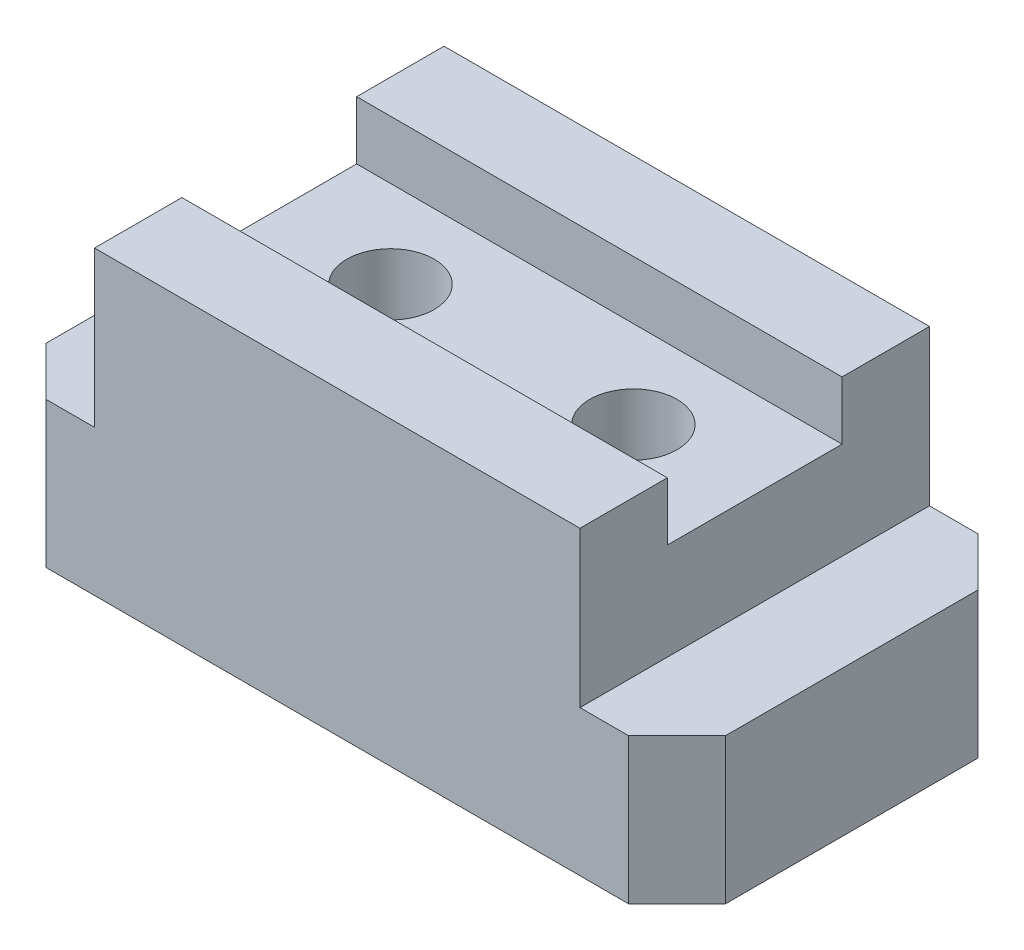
from build123d import *

# Parameters (mm, degrees)
BASE_EXTRUSION_DEPTH    = 36
ESQUISSE2_R             = 7.5
ENL_V_MAT_EXTRU_1_DEPTH = 10
ENL_V_START             = -21
ESQUISSE3_R             = 4.5
ENL_V_MAT_EXTRU_5_DEPTH = 21
ESQUISSE4_W             = 18
ESQUISSE4_H             = 7.016444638
ENL_V_MAT_EXTRU_6_DEPTH = 77.531039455
CHANFREIN1_SIZE         = 5


with BuildPart() as part:
    # Esquisse1 → Base-Extrusion (new body)
    with BuildSketch(Plane.XY):
        Polygon((0, 0), (0, 15), (10, 15), (10, 31), (60, 31), (60, 15), (70, 15), (70, 0), align=None)
    extrude(amount=-BASE_EXTRUSION_DEPTH)

    # Esquisse2 → Enl_v. mat.-Extru.1 (cut)
    with BuildSketch(Plane.XZ):
        with Locations((22.5, -18)):
            Circle(ESQUISSE2_R)
        with Locations((47.5, -18)):
            Circle(ESQUISSE2_R)
    extrude(amount=-ENL_V_MAT_EXTRU_1_DEPTH, mode=Mode.SUBTRACT)

    # Esquisse3 → Enl_v. mat.-Extru.5 (cut)
    with BuildSketch(Plane.XZ.offset(-10).offset(ENL_V_START)):
        with Locations((22.48458693, -18)):
            Circle(ESQUISSE3_R)
        with Locations((47.5, -18)):
            Circle(ESQUISSE3_R)
    extrude(amount=ENL_V_MAT_EXTRU_5_DEPTH, mode=Mode.SUBTRACT)

    # Esquisse4 → Enl_v. mat.-Extru.6 (cut, through all)
    with BuildSketch(Plane(origin=(60, 0, 0), x_dir=(0, 0, -1), z_dir=(1, 0, 0))):
        with Locations((18, 28.508222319)):
            Rectangle(ESQUISSE4_W, ESQUISSE4_H)
    extrude(amount=-ENL_V_MAT_EXTRU_6_DEPTH, mode=Mode.SUBTRACT)

    # Chanfrein1
    chanfrein1_edges = [part.edges().sort_by_distance(p)[0] for p in [
        (0, 7.5, -36),
        (70, 7.5, -36),
        (70, 7.5, 0),
        (0, 7.5, 0),
    ]]
    chamfer(chanfrein1_edges, length=CHANFREIN1_SIZE)


solid = part.part
